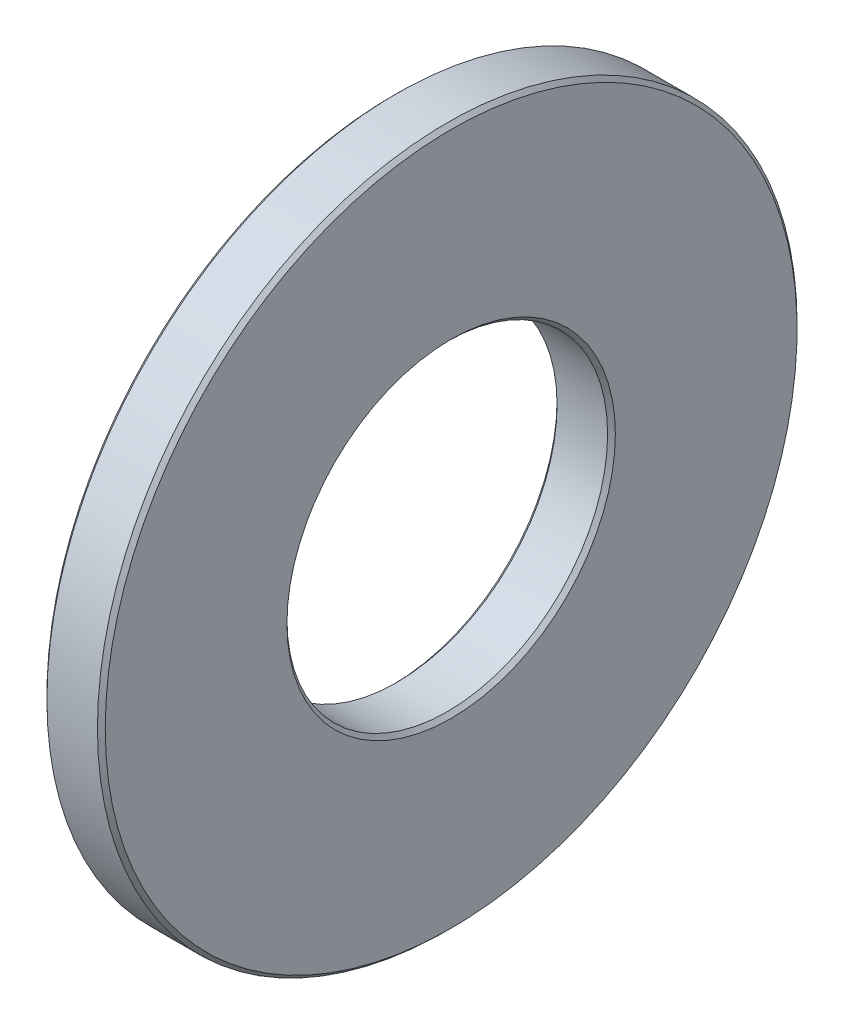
from build123d import *

# Parameters (mm, degrees)
ESQUISSE1_W     = 1.5
ESQUISSE1_H     = 4.875
CHANFREIN1_SIZE = 0.1


with BuildPart() as part:
    # Esquisse1 → Base-R_volution (revolve)
    with BuildSketch(Plane.XY, mode=Mode.PRIVATE) as base_r_volution_sk:
        with Locations((0.75, 6.5625)):
            Rectangle(ESQUISSE1_W, ESQUISSE1_H)
    revolve(base_r_volution_sk.sketch.rotate(Axis((0, 0, 0), (1, 0, 0)), 90), axis=Axis((0, 0, 0), (1, 0, 0)))

    # Chanfrein1
    chanfrein1_edges = [part.edges().sort_by_distance(p)[0] for p in [
        (0, 0, -4.125),
        (1.5, 0, -4.125),
        (1.5, 0, -9),
        (0, 0, -9),
    ]]
    chamfer(chanfrein1_edges, length=CHANFREIN1_SIZE)


solid = part.part
